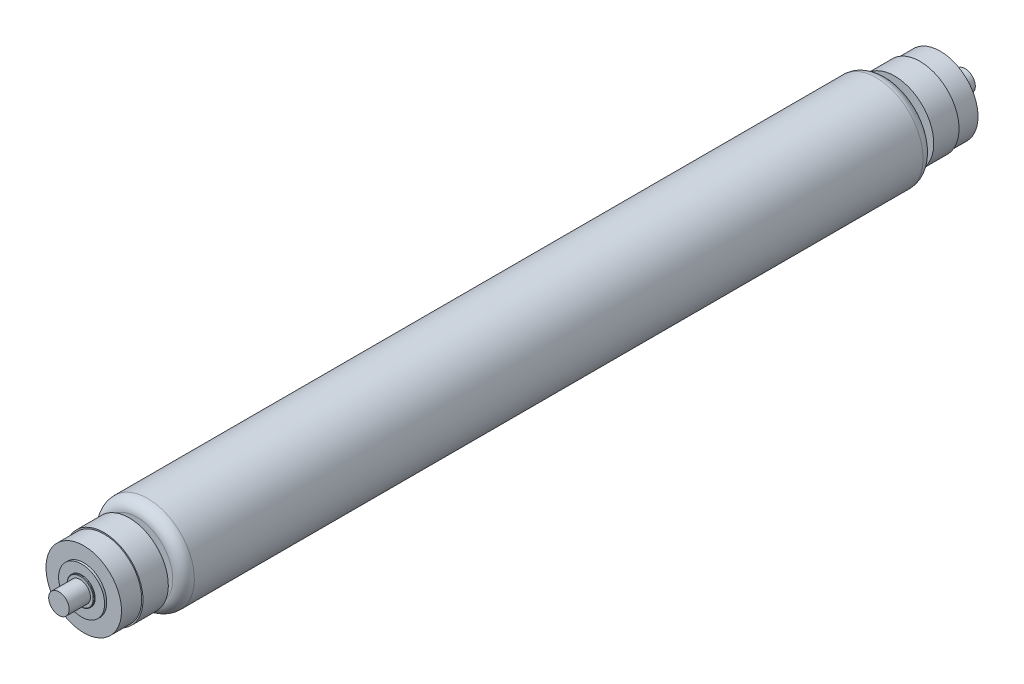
from build123d import *


with BuildPart() as part:
    # Sketch3 → Revolve1 (revolve)
    with BuildSketch(Plane(origin=(0, 0, 0), x_dir=(0, 0, -1), z_dir=(1, 0, 0)), mode=Mode.PRIVATE) as revolve1_sk:
        with BuildLine():
            Line((-192.3288, -10.9855), (-20.8788, -10.9855))
            ThreePointArc((-20.8788, -10.9855), (-19.082748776, -10.241551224), (-18.3388, -8.4455))
            Line((-18.3388, -8.4455), (-18.3388, -4.207282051))
            Line((-18.3388, -4.207282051), (-16.5608, -6.35))
            Line((-16.5608, -6.35), (-16.5608, -9.1821))
            Line((-16.5608, -9.1821), (-10.6045, -9.1821))
            Line((-10.6045, -9.1821), (-10.6045, -8.884691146))
            Line((-10.6045, -8.884691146), (-5.842, -8.884691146))
            Line((-5.842, -8.884691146), (-5.842, -5.4102))
            Line((-5.842, -5.4102), (-5.334, -5.4102))
            Line((-5.334, -5.4102), (-5.334, -3.192668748))
            Line((-5.334, -3.192668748), (-5.131990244, -3.192668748))
            Line((-5.131990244, -3.192668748), (-5.0038, -3.06447825))
            Line((-5.0038, -3.06447825), (-5.0038, -2.413))
            Line((-5.0038, -2.413), (0, -2.413))
            Line((0, -2.413), (0, 0))
            Line((0, 0), (-213.2076, 0))
            Line((-213.2076, 0), (-213.2076, -2.413))
            Line((-213.2076, -2.413), (-208.2038, -2.413))
            Line((-208.2038, -2.413), (-208.2038, -3.06447825))
            Line((-208.2038, -3.06447825), (-208.075609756, -3.192668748))
            Line((-208.075609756, -3.192668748), (-207.8736, -3.192668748))
            Line((-207.8736, -3.192668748), (-207.8736, -5.4102))
            Line((-207.8736, -5.4102), (-207.3656, -5.4102))
            Line((-207.3656, -5.4102), (-207.3656, -8.884691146))
            Line((-207.3656, -8.884691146), (-202.6031, -8.884691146))
            Line((-202.6031, -8.884691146), (-202.6031, -9.1821))
            Line((-202.6031, -9.1821), (-196.6468, -9.1821))
            Line((-196.6468, -9.1821), (-196.6468, -6.35))
            Line((-196.6468, -6.35), (-194.8688, -4.207282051))
            Line((-194.8688, -4.207282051), (-194.8688, -8.4455))
            ThreePointArc((-194.8688, -8.4455), (-194.124851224, -10.241551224), (-192.3288, -10.9855))
        make_face()
    revolve(revolve1_sk.sketch.rotate(Axis((0, 0, 0), (0, 0, 1)), 180), axis=Axis((0, 0, 0), (0, 0, 1)))


solid = part.part
